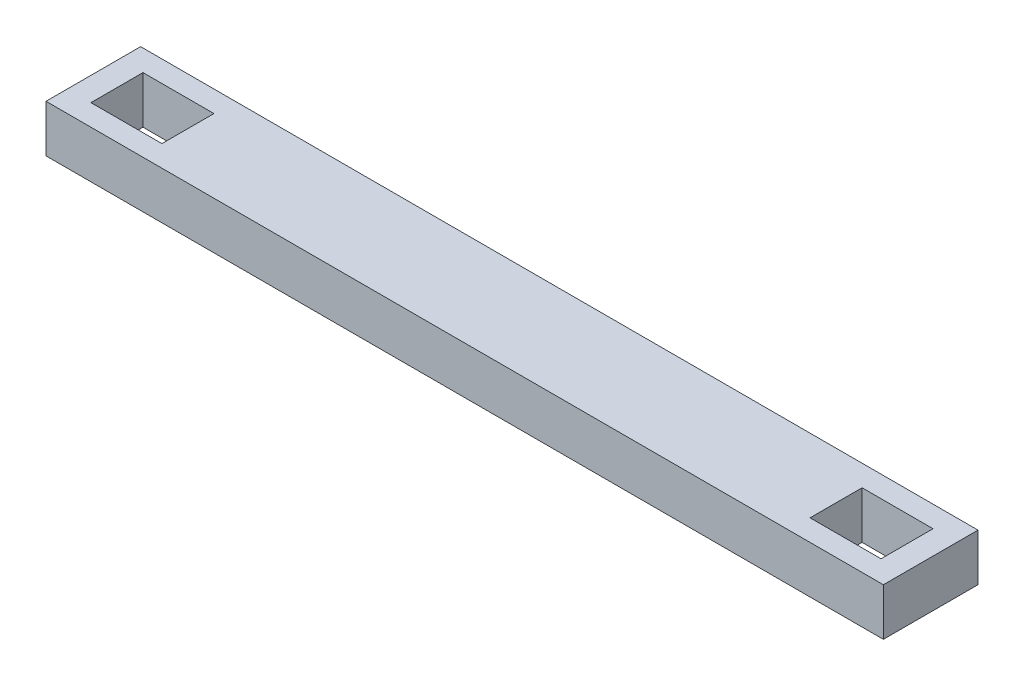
from build123d import *

# Parameters (mm, degrees)
SKETCH1_W           = 25
SKETCH1_H           = 20
SKETCH1_W_2         = 15
SKETCH1_H_2         = 11
SKETCH1_W_3         = 127
BOSS_EXTRUDE1_DEPTH = 10


with BuildPart() as part:
    # Sketch1 → Boss-Extrude1 (new body)
    # profile 1 of 3: a face of its own
    with BuildSketch(Plane(origin=(0, 0, 0), x_dir=(1, 0, 0), z_dir=(0, 1, 0))):
        Rectangle(SKETCH1_W, SKETCH1_H)
        Rectangle(SKETCH1_W_2, SKETCH1_H_2, mode=Mode.SUBTRACT)
    # profile 2 of 3: a face of its own
    with BuildSketch(Plane(origin=(0, 0, 0), x_dir=(1, 0, 0), z_dir=(0, 1, 0))):
        with Locations((76, 0)):
            Rectangle(SKETCH1_W_3, SKETCH1_H)
    # profile 3 of 3: a face of its own
    with BuildSketch(Plane(origin=(0, 0, 0), x_dir=(1, 0, 0), z_dir=(0, 1, 0))):
        with Locations((152, 0)):
            Rectangle(SKETCH1_W, SKETCH1_H)
        with Locations((152, 0)):
            Rectangle(SKETCH1_W_2, SKETCH1_H_2, mode=Mode.SUBTRACT)
    extrude(amount=BOSS_EXTRUDE1_DEPTH)


solid = part.part
